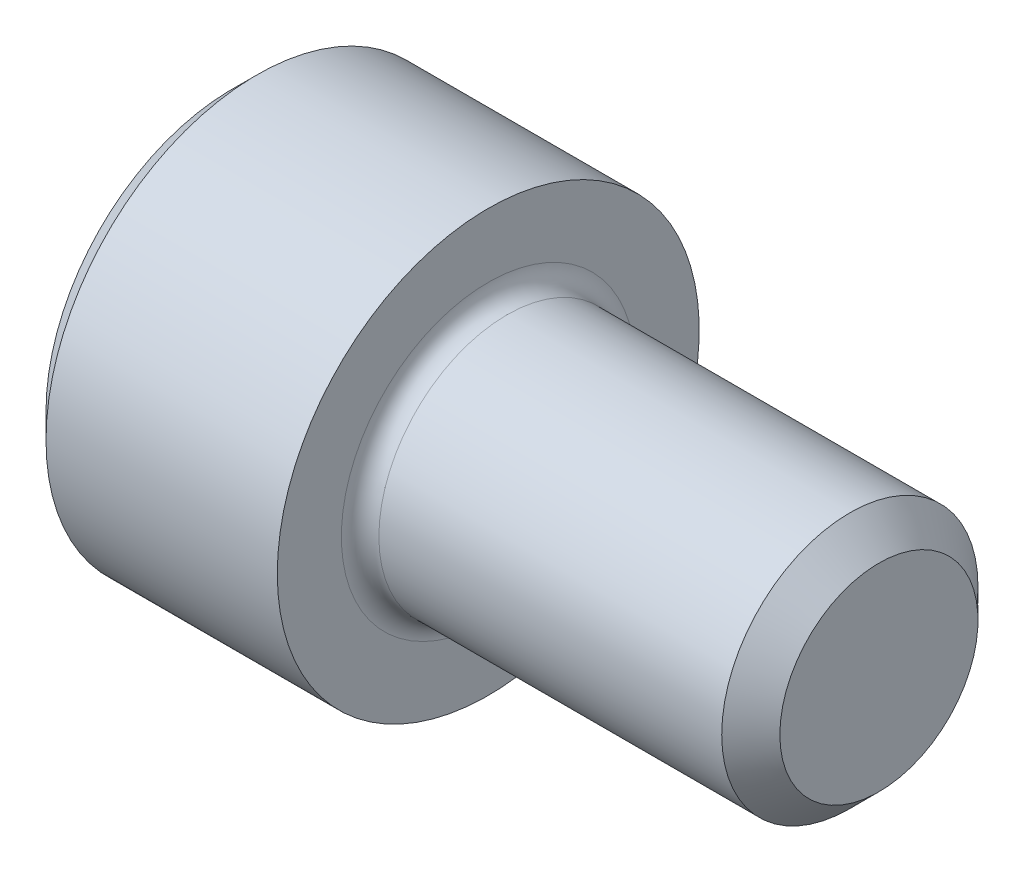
from build123d import *

# Parameters (mm, degrees)
FILLET1_R   = 0.3048
HEX_2_DEPTH = 1.9558


with BuildPart() as part:
    # BodySke → Base-Revolve (revolve)
    with BuildSketch(Plane.XY, mode=Mode.PRIVATE) as base_revolve_sk:
        Polygon((0, 0), (0, 3.0226), (0.4064, 3.429), (4.1656, 3.429), (4.1656, 2.0828), (10.04316, 2.0828), (10.5156, 1.61036), (10.5156, 0), align=None)
    revolve(base_revolve_sk.sketch.rotate(Axis((-31.75, 0, 0), (1, 0, 0)), 90), axis=Axis((-31.75, 0, 0), (1, 0, 0)))

    # Fillet1
    fillet1_edges = [part.edges().sort_by_distance(p)[0] for p in [
        (4.1656, 0, -2.0828),
    ]]
    fillet(fillet1_edges, radius=FILLET1_R)

    # Sketch2 → Hex-PreBroach (revolve, cut)
    with BuildSketch(Plane.XY, mode=Mode.PRIVATE) as hex_prebroach_sk:
        Polygon((0, 1.778), (1.9558, 1.778), (2.982328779, 0), (0, 0), align=None)
    revolve(hex_prebroach_sk.sketch.rotate(Axis((0, 0, 0), (1, 0, 0)), 90), axis=Axis((0, 0, 0), (1, 0, 0)), mode=Mode.SUBTRACT)

    # Sketch3 → Hex 2 (cut)
    with BuildSketch(Plane(origin=(0, 0, 0), x_dir=(0, 0.500000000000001, 0.866025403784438), z_dir=(-1, 0, 0))):
        Polygon((1.026528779, 1.778), (-1.026528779, 1.778), (-2.053057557, 0), (-1.026528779, -1.778), (1.026528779, -1.778), (2.053057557, 0), align=None)
    extrude(amount=-HEX_2_DEPTH, mode=Mode.SUBTRACT)


solid = part.part
